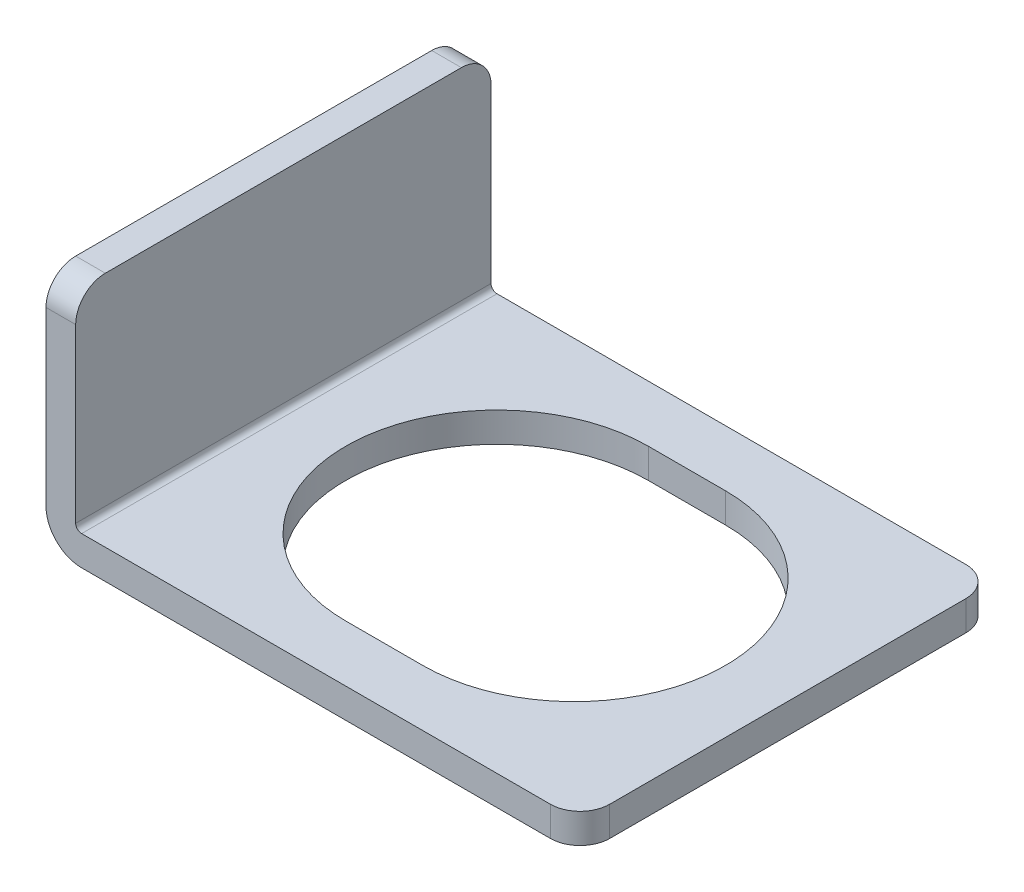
from build123d import *

# Parameters (mm, degrees)
BOSS_EXTRUDE1_DEPTH = 7
CUT_EXTRUDE1_DEPTH  = 21.542638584
FILLET1_R           = 1


with BuildPart() as part:
    # Sketch1 → Boss-Extrude1 (new, symmetric)
    with BuildSketch(Plane.XY):
        with BuildLine():
            Line((0, 1.2), (0, 8))
            Line((0, 8), (1, 8))
            Line((1, 8), (1, 1.2))
            ThreePointArc((1, 1.2), (1.058578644, 1.058578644), (1.2, 1))
            Line((1.2, 1), (18, 1))
            Line((18, 1), (18, 0))
            Line((18, 0), (1.2, 0))
            ThreePointArc((1.2, 0), (0.351471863, 0.351471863), (0, 1.2))
        make_face()
    extrude(amount=BOSS_EXTRUDE1_DEPTH, both=True)

    # Sketch2 → Cut-Extrude1 (cut, through all)
    with BuildSketch(Plane(origin=(0, 1, 0), x_dir=(1, 0, 0), z_dir=(0, 1, 0))):
        with BuildLine():
            Line((8.2, 5.1), (10.8, 5.1))
            ThreePointArc((10.8, 5.1), (15.9, 0), (10.8, -5.1))
            Line((10.8, -5.1), (8.2, -5.1))
            ThreePointArc((8.2, -5.1), (3.1, 0), (8.2, 5.1))
        make_face()
    extrude(amount=-CUT_EXTRUDE1_DEPTH, mode=Mode.SUBTRACT)

    # Fillet1
    fillet1_edges = [part.edges().sort_by_distance(p)[0] for p in [
        (0.5, 8, -7),
        (18, 0.5, 7),
        (0.5, 8, 7),
        (18, 0.5, -7),
    ]]
    fillet(fillet1_edges, radius=FILLET1_R)


solid = part.part
